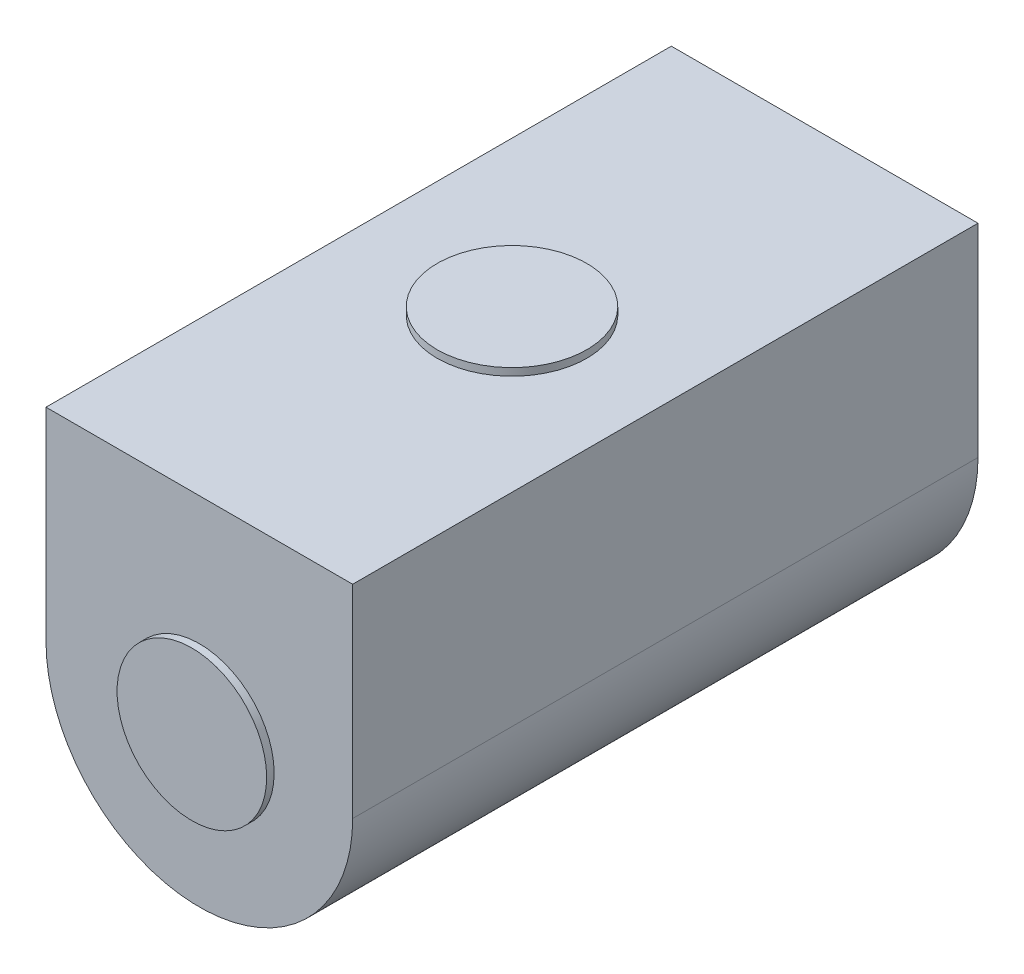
from build123d import *

# Parameters (mm, degrees)
EXTRUDE1_DEPTH = 20.9
SKETCH3_R      = 5
EXTRUDE5_DEPTH = 0.5
SKETCH4_R      = 5
EXTRUDE6_DEPTH = 0.5


with BuildPart() as part:
    # Sketch1 → Extrude1 (new, symmetric)
    with BuildSketch(Plane.XY):
        with BuildLine():
            Line((-10.25, 13.5625), (-10.25, 0))
            ThreePointArc((-10.25, 0), (0, -10.25), (10.25, 0))
            Line((10.25, 0), (10.25, 13.5625))
            Line((10.25, 13.5625), (-10.25, 13.5625))
        make_face()
    extrude(amount=EXTRUDE1_DEPTH, both=True)

    # Sketch3 → Extrude5 (add)
    with BuildSketch(Plane.XY.offset(20.9)):
        Circle(SKETCH3_R)
    extrude5 = extrude(amount=EXTRUDE5_DEPTH)

    # Mirror1: Extrude5 across plane
    add(extrude5.mirror(Plane.XY))

    # Sketch4 → Extrude6 (add)
    with BuildSketch(Plane(origin=(0, 13.5625, 0), x_dir=(1, 0, 0), z_dir=(0, 1, 0))):
        with Locations(Location((0, 0, 0), (0, 0, 270))):
            Circle(SKETCH4_R)
    extrude(amount=EXTRUDE6_DEPTH)


solid = part.part
